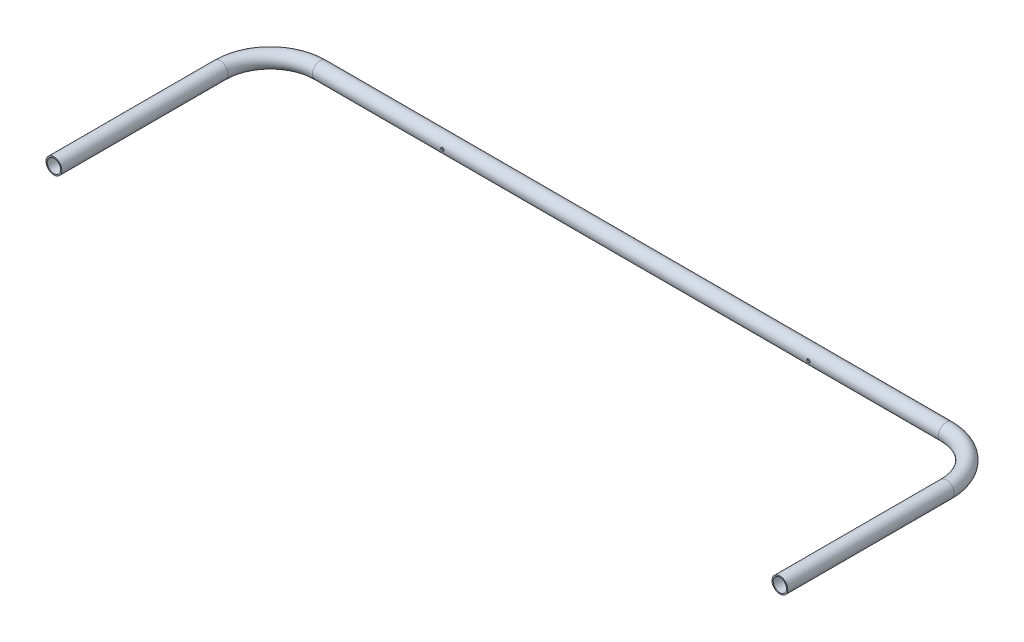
from build123d import *

# Parameters (mm, degrees)
SKETCH2_R          = 24.13
SKETCH2_R_2        = 20.447
SKETCH6_R          = 4.826
CUT_EXTRUDE1_DEPTH = 1324.273116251


with BuildPart() as part:
    # Sweep2: sweep along a path in Sketch1
    with BuildLine(Plane(origin=(0, 0, 0), x_dir=(1, 0, 0), z_dir=(0, 1, 0))) as sweep2_path:
        Line((0, 660.4), (955.675, 660.4))
        ThreePointArc((955.675, 660.4), (1063.438073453, 615.763073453), (1108.075, 508))
        Line((1108.075, 508), (1108.075, 0))
    # Sketch2 → Sweep2 (sweep)
    with BuildSketch(Plane(origin=(0, 0, 0), x_dir=(0, 0, -1), z_dir=(1, 0, 0))):
        with Locations((660.4, 0)):
            Circle(SKETCH2_R)
        with Locations((660.4, 0)):
            Circle(SKETCH2_R_2, mode=Mode.SUBTRACT)
    sweep2 = sweep(path=sweep2_path.line)

    # Mirror1: Sweep2 across Right Plane
    add(sweep2.mirror(Plane(origin=(0, 0, 0), x_dir=(0, 0, -1), z_dir=(1, 0, 0))))

    # Sketch6 → Cut-Extrude1 (cut, through all)
    with BuildSketch(Plane(origin=(0, 0, 0), x_dir=(1, 0, 0), z_dir=(0, 0, -1))):
        with Locations((558.8, 0)):
            Circle(SKETCH6_R)
        with Locations((-558.8, 0)):
            Circle(SKETCH6_R)
    extrude(amount=CUT_EXTRUDE1_DEPTH, mode=Mode.SUBTRACT)


solid = part.part
